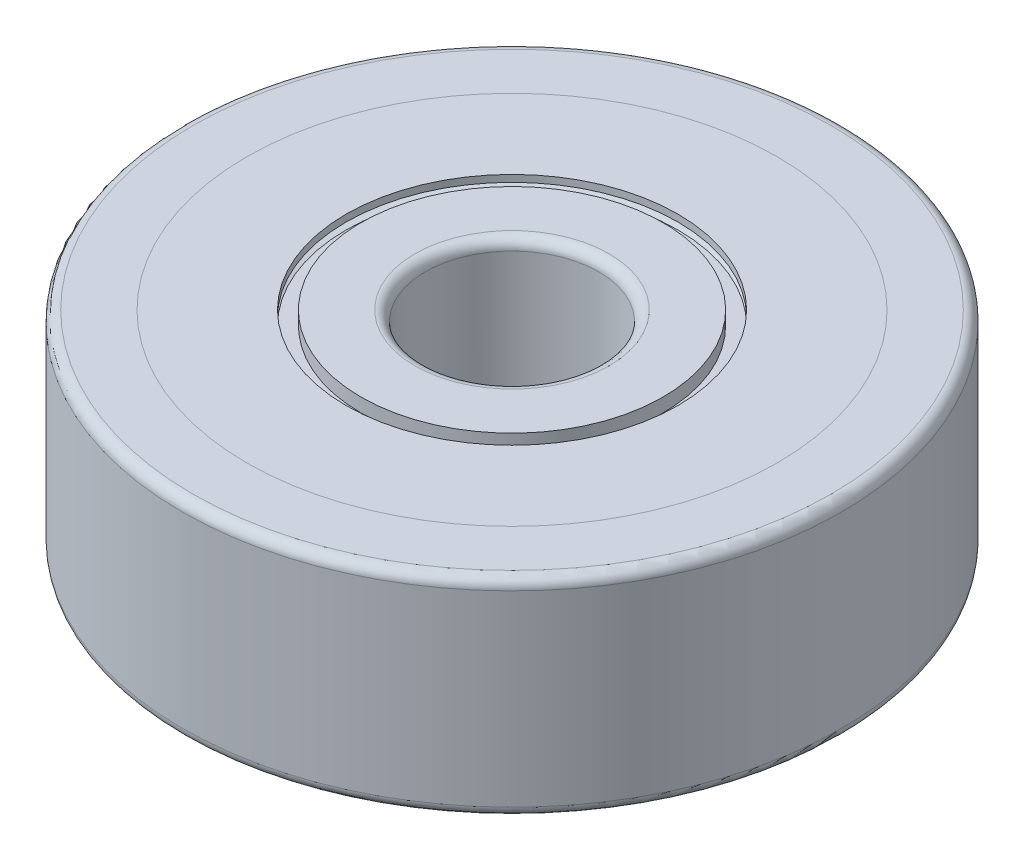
ISO-10303-21;
HEADER;
FILE_DESCRIPTION(('STEP AP214'),'2;1');
FILE_NAME('part.step','',(''),(''),'','','');
FILE_SCHEMA(('AUTOMOTIVE_DESIGN { 1 0 10303 214 1 1 1 1 }'));
ENDSEC;
DATA;
#1=APPLICATION_CONTEXT('core data for automotive mechanical design processes');
#2=APPLICATION_PROTOCOL_DEFINITION('international standard','automotive_design',2000,#1);
#3=PRODUCT_CONTEXT('',#1,'mechanical');
#4=PRODUCT('Part','Part','',(#3));
#5=PRODUCT_RELATED_PRODUCT_CATEGORY('part','',(#4));
#6=PRODUCT_DEFINITION_FORMATION('','',#4);
#7=PRODUCT_DEFINITION_CONTEXT('part definition',#1,'design');
#8=PRODUCT_DEFINITION('design','',#6,#7);
#9=PRODUCT_DEFINITION_SHAPE('','',#8);
#10=(LENGTH_UNIT() NAMED_UNIT(*) SI_UNIT(.MILLI.,.METRE.));
#11=(NAMED_UNIT(*) PLANE_ANGLE_UNIT() SI_UNIT($,.RADIAN.));
#12=(NAMED_UNIT(*) SI_UNIT($,.STERADIAN.) SOLID_ANGLE_UNIT());
#13=UNCERTAINTY_MEASURE_WITH_UNIT(LENGTH_MEASURE(1.E-05),#10,'distance_accuracy_value','');
#14=(GEOMETRIC_REPRESENTATION_CONTEXT(3) GLOBAL_UNCERTAINTY_ASSIGNED_CONTEXT((#13)) GLOBAL_UNIT_ASSIGNED_CONTEXT((#10,
#11,#12)) REPRESENTATION_CONTEXT('',''));
#15=CARTESIAN_POINT('',(0.,0.,0.));
#16=DIRECTION('',(0.,0.,1.));
#17=DIRECTION('',(1.,0.,0.));
#18=AXIS2_PLACEMENT_3D('',#15,#16,#17);
#19=CARTESIAN_POINT('',(0.,6.,0.));
#20=DIRECTION('',(0.,-1.,0.));
#21=DIRECTION('',(0.,0.,-1.));
#22=AXIS2_PLACEMENT_3D('',#19,#20,#21);
#23=CYLINDRICAL_SURFACE('',#22,2.5);
#24=CARTESIAN_POINT('',(0.,5.7,0.));
#25=DIRECTION('',(0.,1.,0.));
#26=DIRECTION('',(0.,0.,-1.));
#27=AXIS2_PLACEMENT_3D('',#24,#25,#26);
#28=CIRCLE('',#27,2.5);
#29=CARTESIAN_POINT('',(0.,5.7,-2.5));
#30=VERTEX_POINT('',#29);
#31=EDGE_CURVE('P0_E81',#30,#30,#28,.F.);
#32=ORIENTED_EDGE('',*,*,#31,.F.);
#33=EDGE_LOOP('',(#32));
#34=FACE_BOUND('',#33,.T.);
#35=CARTESIAN_POINT('',(0.,0.3,0.));
#36=DIRECTION('',(0.,-1.,0.));
#37=DIRECTION('',(0.,0.,1.));
#38=AXIS2_PLACEMENT_3D('',#35,#36,#37);
#39=CIRCLE('',#38,2.5);
#40=CARTESIAN_POINT('',(0.,0.3,2.5));
#41=VERTEX_POINT('',#40);
#42=EDGE_CURVE('P0_E77',#41,#41,#39,.F.);
#43=ORIENTED_EDGE('',*,*,#42,.F.);
#44=EDGE_LOOP('',(#43));
#45=FACE_BOUND('',#44,.T.);
#46=ADVANCED_FACE('P0_F15',(#34,#45),#23,.F.);
#47=CARTESIAN_POINT('',(0.,5.7,0.));
#48=DIRECTION('',(0.,1.,0.));
#49=DIRECTION('',(0.,0.,-1.));
#50=AXIS2_PLACEMENT_3D('',#47,#48,#49);
#51=TOROIDAL_SURFACE('',#50,2.8,0.3);
#52=CARTESIAN_POINT('',(0.,6.,0.));
#53=DIRECTION('',(0.,1.,0.));
#54=DIRECTION('',(0.,0.,1.));
#55=AXIS2_PLACEMENT_3D('',#52,#53,#54);
#56=CIRCLE('',#55,2.8);
#57=CARTESIAN_POINT('',(0.,6.,2.8));
#58=VERTEX_POINT('',#57);
#59=EDGE_CURVE('P0_E80',#58,#58,#56,.F.);
#60=ORIENTED_EDGE('',*,*,#59,.F.);
#61=EDGE_LOOP('',(#60));
#62=FACE_BOUND('',#61,.T.);
#63=ORIENTED_EDGE('',*,*,#31,.T.);
#64=EDGE_LOOP('',(#63));
#65=FACE_BOUND('',#64,.T.);
#66=ADVANCED_FACE('P0_F97',(#62,#65),#51,.T.);
#67=CARTESIAN_POINT('',(0.,0.3,0.));
#68=DIRECTION('',(0.,-1.,0.));
#69=DIRECTION('',(0.,0.,1.));
#70=AXIS2_PLACEMENT_3D('',#67,#68,#69);
#71=TOROIDAL_SURFACE('',#70,2.8,0.3);
#72=ORIENTED_EDGE('',*,*,#42,.T.);
#73=EDGE_LOOP('',(#72));
#74=FACE_BOUND('',#73,.T.);
#75=CARTESIAN_POINT('',(0.,0.,0.));
#76=DIRECTION('',(0.,-1.,0.));
#77=DIRECTION('',(0.,0.,-1.));
#78=AXIS2_PLACEMENT_3D('',#75,#76,#77);
#79=CIRCLE('',#78,2.8);
#80=CARTESIAN_POINT('',(0.,0.,-2.8));
#81=VERTEX_POINT('',#80);
#82=EDGE_CURVE('P0_E40',#81,#81,#79,.F.);
#83=ORIENTED_EDGE('',*,*,#82,.F.);
#84=EDGE_LOOP('',(#83));
#85=FACE_BOUND('',#84,.T.);
#86=ADVANCED_FACE('P0_F64',(#74,#85),#71,.T.);
#87=CARTESIAN_POINT('',(0.,6.,0.));
#88=DIRECTION('',(0.,1.,0.));
#89=DIRECTION('',(0.,0.,1.));
#90=AXIS2_PLACEMENT_3D('',#87,#88,#89);
#91=PLANE('',#90);
#92=CARTESIAN_POINT('',(0.,6.,0.));
#93=DIRECTION('',(0.,1.,0.));
#94=DIRECTION('',(0.,0.,1.));
#95=AXIS2_PLACEMENT_3D('',#92,#93,#94);
#96=CIRCLE('',#95,4.355);
#97=CARTESIAN_POINT('',(0.,6.,4.355));
#98=VERTEX_POINT('',#97);
#99=EDGE_CURVE('P0_E18',#98,#98,#96,.F.);
#100=ORIENTED_EDGE('',*,*,#99,.F.);
#101=EDGE_LOOP('',(#100));
#102=FACE_BOUND('',#101,.T.);
#103=ORIENTED_EDGE('',*,*,#59,.T.);
#104=EDGE_LOOP('',(#103));
#105=FACE_BOUND('',#104,.T.);
#106=ADVANCED_FACE('P0_F58',(#102,#105),#91,.T.);
#107=CARTESIAN_POINT('',(0.,0.,0.));
#108=DIRECTION('',(0.,-1.,0.));
#109=DIRECTION('',(0.,0.,-1.));
#110=AXIS2_PLACEMENT_3D('',#107,#108,#109);
#111=PLANE('',#110);
#112=CARTESIAN_POINT('',(0.,0.,0.));
#113=DIRECTION('',(0.,-1.,0.));
#114=DIRECTION('',(0.,0.,-1.));
#115=AXIS2_PLACEMENT_3D('',#112,#113,#114);
#116=CIRCLE('',#115,4.355);
#117=CARTESIAN_POINT('',(0.,0.,-4.355));
#118=VERTEX_POINT('',#117);
#119=EDGE_CURVE('P0_E122',#118,#118,#116,.F.);
#120=ORIENTED_EDGE('',*,*,#119,.F.);
#121=EDGE_LOOP('',(#120));
#122=FACE_BOUND('',#121,.T.);
#123=ORIENTED_EDGE('',*,*,#82,.T.);
#124=EDGE_LOOP('',(#123));
#125=FACE_BOUND('',#124,.T.);
#126=ADVANCED_FACE('P0_F47',(#122,#125),#111,.T.);
#127=CARTESIAN_POINT('',(0.,5.604,0.));
#128=DIRECTION('',(0.,1.,0.));
#129=DIRECTION('',(0.,0.,1.));
#130=AXIS2_PLACEMENT_3D('',#127,#128,#129);
#131=CYLINDRICAL_SURFACE('',#130,4.355);
#132=CARTESIAN_POINT('',(0.,5.604,0.));
#133=DIRECTION('',(0.,1.,0.));
#134=DIRECTION('',(0.,0.,1.));
#135=AXIS2_PLACEMENT_3D('',#132,#133,#134);
#136=CIRCLE('',#135,4.355);
#137=CARTESIAN_POINT('',(0.,5.604,4.355));
#138=VERTEX_POINT('',#137);
#139=EDGE_CURVE('P0_E120',#138,#138,#136,.T.);
#140=ORIENTED_EDGE('',*,*,#139,.T.);
#141=EDGE_LOOP('',(#140));
#142=FACE_BOUND('',#141,.T.);
#143=ORIENTED_EDGE('',*,*,#99,.T.);
#144=EDGE_LOOP('',(#143));
#145=FACE_BOUND('',#144,.T.);
#146=ADVANCED_FACE('P0_F57',(#142,#145),#131,.T.);
#147=CARTESIAN_POINT('',(0.,0.396,0.));
#148=DIRECTION('',(0.,-1.,0.));
#149=DIRECTION('',(0.,0.,-1.));
#150=AXIS2_PLACEMENT_3D('',#147,#148,#149);
#151=CYLINDRICAL_SURFACE('',#150,4.355);
#152=CARTESIAN_POINT('',(0.,0.396,0.));
#153=DIRECTION('',(0.,-1.,0.));
#154=DIRECTION('',(0.,0.,-1.));
#155=AXIS2_PLACEMENT_3D('',#152,#153,#154);
#156=CIRCLE('',#155,4.355);
#157=CARTESIAN_POINT('',(0.,0.396,-4.355));
#158=VERTEX_POINT('',#157);
#159=EDGE_CURVE('P0_E117',#158,#158,#156,.T.);
#160=ORIENTED_EDGE('',*,*,#159,.T.);
#161=EDGE_LOOP('',(#160));
#162=FACE_BOUND('',#161,.T.);
#163=ORIENTED_EDGE('',*,*,#119,.T.);
#164=EDGE_LOOP('',(#163));
#165=FACE_BOUND('',#164,.T.);
#166=ADVANCED_FACE('P0_F163',(#162,#165),#151,.T.);
#167=CARTESIAN_POINT('',(0.,5.604,0.));
#168=DIRECTION('',(0.,-1.,0.));
#169=DIRECTION('',(0.,0.,-1.));
#170=AXIS2_PLACEMENT_3D('',#167,#168,#169);
#171=PLANE('',#170);
#172=ORIENTED_EDGE('',*,*,#139,.F.);
#173=EDGE_LOOP('',(#172));
#174=FACE_BOUND('',#173,.T.);
#175=CARTESIAN_POINT('',(0.,5.604,0.));
#176=DIRECTION('',(0.,1.,0.));
#177=DIRECTION('',(0.,0.,1.));
#178=AXIS2_PLACEMENT_3D('',#175,#176,#177);
#179=CIRCLE('',#178,4.782);
#180=CARTESIAN_POINT('',(0.,5.604,4.782));
#181=VERTEX_POINT('',#180);
#182=EDGE_CURVE('P0_E114',#181,#181,#179,.F.);
#183=ORIENTED_EDGE('',*,*,#182,.F.);
#184=EDGE_LOOP('',(#183));
#185=FACE_BOUND('',#184,.T.);
#186=ADVANCED_FACE('P0_F160',(#174,#185),#171,.F.);
#187=CARTESIAN_POINT('',(0.,0.396,0.));
#188=DIRECTION('',(0.,1.,0.));
#189=DIRECTION('',(0.,0.,1.));
#190=AXIS2_PLACEMENT_3D('',#187,#188,#189);
#191=PLANE('',#190);
#192=ORIENTED_EDGE('',*,*,#159,.F.);
#193=EDGE_LOOP('',(#192));
#194=FACE_BOUND('',#193,.T.);
#195=CARTESIAN_POINT('',(0.,0.396,0.));
#196=DIRECTION('',(0.,1.,0.));
#197=DIRECTION('',(0.,0.,1.));
#198=AXIS2_PLACEMENT_3D('',#195,#196,#197);
#199=CIRCLE('',#198,4.782);
#200=CARTESIAN_POINT('',(0.,0.396,4.782));
#201=VERTEX_POINT('',#200);
#202=EDGE_CURVE('P0_E27',#201,#201,#199,.T.);
#203=ORIENTED_EDGE('',*,*,#202,.F.);
#204=EDGE_LOOP('',(#203));
#205=FACE_BOUND('',#204,.T.);
#206=ADVANCED_FACE('P0_F156',(#194,#205),#191,.F.);
#207=CARTESIAN_POINT('',(0.,0.,0.));
#208=DIRECTION('',(0.,1.,0.));
#209=DIRECTION('',(0.,0.,1.));
#210=AXIS2_PLACEMENT_3D('',#207,#208,#209);
#211=CYLINDRICAL_SURFACE('',#210,4.782);
#212=CARTESIAN_POINT('',(0.,4.71069459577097,0.));
#213=DIRECTION('',(0.,1.,0.));
#214=DIRECTION('',(0.,0.,-1.));
#215=AXIS2_PLACEMENT_3D('',#212,#213,#214);
#216=CIRCLE('',#215,4.782);
#217=CARTESIAN_POINT('',(0.,4.71069459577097,-4.782));
#218=VERTEX_POINT('',#217);
#219=EDGE_CURVE('P0_E22',#218,#218,#216,.T.);
#220=ORIENTED_EDGE('',*,*,#219,.T.);
#221=EDGE_LOOP('',(#220));
#222=FACE_BOUND('',#221,.T.);
#223=ORIENTED_EDGE('',*,*,#182,.T.);
#224=EDGE_LOOP('',(#223));
#225=FACE_BOUND('',#224,.T.);
#226=ADVANCED_FACE('P0_F150',(#222,#225),#211,.T.);
#227=CARTESIAN_POINT('',(0.,0.,0.));
#228=DIRECTION('',(0.,1.,0.));
#229=DIRECTION('',(0.,0.,1.));
#230=AXIS2_PLACEMENT_3D('',#227,#228,#229);
#231=CYLINDRICAL_SURFACE('',#230,4.782);
#232=CARTESIAN_POINT('',(0.,1.28930540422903,0.));
#233=DIRECTION('',(0.,1.,0.));
#234=DIRECTION('',(0.,0.,-1.));
#235=AXIS2_PLACEMENT_3D('',#232,#233,#234);
#236=CIRCLE('',#235,4.782);
#237=CARTESIAN_POINT('',(0.,1.28930540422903,-4.782));
#238=VERTEX_POINT('',#237);
#239=EDGE_CURVE('P0_E10',#238,#238,#236,.F.);
#240=ORIENTED_EDGE('',*,*,#239,.T.);
#241=EDGE_LOOP('',(#240));
#242=FACE_BOUND('',#241,.T.);
#243=ORIENTED_EDGE('',*,*,#202,.T.);
#244=EDGE_LOOP('',(#243));
#245=FACE_BOUND('',#244,.T.);
#246=ADVANCED_FACE('P0_F144',(#242,#245),#231,.T.);
#247=CARTESIAN_POINT('',(0.,3.,0.));
#248=DIRECTION('',(0.,1.,0.));
#249=DIRECTION('',(0.,0.,-1.));
#250=AXIS2_PLACEMENT_3D('',#247,#248,#249);
#251=TOROIDAL_SURFACE('',#250,6.,2.1);
#252=ORIENTED_EDGE('',*,*,#239,.F.);
#253=EDGE_LOOP('',(#252));
#254=FACE_BOUND('',#253,.T.);
#255=ORIENTED_EDGE('',*,*,#219,.F.);
#256=EDGE_LOOP('',(#255));
#257=FACE_BOUND('',#256,.T.);
#258=ADVANCED_FACE('P0_F142',(#254,#257),#251,.F.);
#259=CLOSED_SHELL('',(#46,#66,#86,#106,#126,#146,#166,#186,#206,#226,#246,#258));
#260=MANIFOLD_SOLID_BREP('P0_B1',#259);
#261=CARTESIAN_POINT('',(0.,3.,0.));
#262=DIRECTION('',(0.,1.,0.));
#263=DIRECTION('',(0.,0.,-1.));
#264=AXIS2_PLACEMENT_3D('',#261,#262,#263);
#265=TOROIDAL_SURFACE('',#264,6.,2.1);
#266=CARTESIAN_POINT('',(0.,4.71069459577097,0.));
#267=DIRECTION('',(0.,-1.,0.));
#268=DIRECTION('',(0.,0.,-1.));
#269=AXIS2_PLACEMENT_3D('',#266,#267,#268);
#270=CIRCLE('',#269,7.218);
#271=CARTESIAN_POINT('',(0.,4.71069459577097,-7.218));
#272=VERTEX_POINT('',#271);
#273=EDGE_CURVE('P1_E141',#272,#272,#270,.F.);
#274=ORIENTED_EDGE('',*,*,#273,.T.);
#275=EDGE_LOOP('',(#274));
#276=FACE_BOUND('',#275,.T.);
#277=CARTESIAN_POINT('',(0.,1.28930540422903,0.));
#278=DIRECTION('',(0.,-1.,0.));
#279=DIRECTION('',(0.,0.,-1.));
#280=AXIS2_PLACEMENT_3D('',#277,#278,#279);
#281=CIRCLE('',#280,7.218);
#282=CARTESIAN_POINT('',(0.,1.28930540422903,-7.218));
#283=VERTEX_POINT('',#282);
#284=EDGE_CURVE('P1_E144',#283,#283,#281,.T.);
#285=ORIENTED_EDGE('',*,*,#284,.T.);
#286=EDGE_LOOP('',(#285));
#287=FACE_BOUND('',#286,.T.);
#288=ADVANCED_FACE('P1_F15',(#276,#287),#265,.F.);
#289=CARTESIAN_POINT('',(0.,6.,0.));
#290=DIRECTION('',(0.,-1.,0.));
#291=DIRECTION('',(0.,0.,-1.));
#292=AXIS2_PLACEMENT_3D('',#289,#290,#291);
#293=CYLINDRICAL_SURFACE('',#292,7.218);
#294=ORIENTED_EDGE('',*,*,#284,.F.);
#295=EDGE_LOOP('',(#294));
#296=FACE_BOUND('',#295,.T.);
#297=CARTESIAN_POINT('',(0.,0.396,0.));
#298=DIRECTION('',(0.,-1.,0.));
#299=DIRECTION('',(0.,0.,-1.));
#300=AXIS2_PLACEMENT_3D('',#297,#298,#299);
#301=CIRCLE('',#300,7.218);
#302=CARTESIAN_POINT('',(0.,0.396,-7.218));
#303=VERTEX_POINT('',#302);
#304=EDGE_CURVE('P1_E19',#303,#303,#301,.T.);
#305=ORIENTED_EDGE('',*,*,#304,.T.);
#306=EDGE_LOOP('',(#305));
#307=FACE_BOUND('',#306,.T.);
#308=ADVANCED_FACE('P1_F101',(#296,#307),#293,.F.);
#309=CARTESIAN_POINT('',(0.,6.,0.));
#310=DIRECTION('',(0.,-1.,0.));
#311=DIRECTION('',(0.,0.,-1.));
#312=AXIS2_PLACEMENT_3D('',#309,#310,#311);
#313=CYLINDRICAL_SURFACE('',#312,7.218);
#314=ORIENTED_EDGE('',*,*,#273,.F.);
#315=EDGE_LOOP('',(#314));
#316=FACE_BOUND('',#315,.T.);
#317=CARTESIAN_POINT('',(0.,5.604,0.));
#318=DIRECTION('',(0.,-1.,0.));
#319=DIRECTION('',(0.,0.,-1.));
#320=AXIS2_PLACEMENT_3D('',#317,#318,#319);
#321=CIRCLE('',#320,7.218);
#322=CARTESIAN_POINT('',(0.,5.604,-7.218));
#323=VERTEX_POINT('',#322);
#324=EDGE_CURVE('P1_E136',#323,#323,#321,.F.);
#325=ORIENTED_EDGE('',*,*,#324,.T.);
#326=EDGE_LOOP('',(#325));
#327=FACE_BOUND('',#326,.T.);
#328=ADVANCED_FACE('P1_F98',(#316,#327),#313,.F.);
#329=CARTESIAN_POINT('',(0.,0.396,0.));
#330=DIRECTION('',(0.,1.,0.));
#331=DIRECTION('',(0.,0.,1.));
#332=AXIS2_PLACEMENT_3D('',#329,#330,#331);
#333=PLANE('',#332);
#334=ORIENTED_EDGE('',*,*,#304,.F.);
#335=EDGE_LOOP('',(#334));
#336=FACE_BOUND('',#335,.T.);
#337=CARTESIAN_POINT('',(0.,0.396,0.));
#338=DIRECTION('',(0.,1.,0.));
#339=DIRECTION('',(0.,0.,1.));
#340=AXIS2_PLACEMENT_3D('',#337,#338,#339);
#341=CIRCLE('',#340,7.645);
#342=CARTESIAN_POINT('',(0.,0.396,7.645));
#343=VERTEX_POINT('',#342);
#344=EDGE_CURVE('P1_E134',#343,#343,#341,.F.);
#345=ORIENTED_EDGE('',*,*,#344,.T.);
#346=EDGE_LOOP('',(#345));
#347=FACE_BOUND('',#346,.T.);
#348=ADVANCED_FACE('P1_F94',(#336,#347),#333,.F.);
#349=CARTESIAN_POINT('',(0.,5.604,0.));
#350=DIRECTION('',(0.,-1.,0.));
#351=DIRECTION('',(0.,0.,-1.));
#352=AXIS2_PLACEMENT_3D('',#349,#350,#351);
#353=PLANE('',#352);
#354=ORIENTED_EDGE('',*,*,#324,.F.);
#355=EDGE_LOOP('',(#354));
#356=FACE_BOUND('',#355,.T.);
#357=CARTESIAN_POINT('',(0.,5.604,0.));
#358=DIRECTION('',(0.,-1.,0.));
#359=DIRECTION('',(0.,0.,-1.));
#360=AXIS2_PLACEMENT_3D('',#357,#358,#359);
#361=CIRCLE('',#360,7.645);
#362=CARTESIAN_POINT('',(0.,5.604,-7.645));
#363=VERTEX_POINT('',#362);
#364=EDGE_CURVE('P1_E127',#363,#363,#361,.F.);
#365=ORIENTED_EDGE('',*,*,#364,.T.);
#366=EDGE_LOOP('',(#365));
#367=FACE_BOUND('',#366,.T.);
#368=ADVANCED_FACE('P1_F90',(#356,#367),#353,.F.);
#369=CARTESIAN_POINT('',(0.,0.,0.));
#370=DIRECTION('',(0.,1.,0.));
#371=DIRECTION('',(0.,0.,1.));
#372=AXIS2_PLACEMENT_3D('',#369,#370,#371);
#373=CYLINDRICAL_SURFACE('',#372,7.645);
#374=CARTESIAN_POINT('',(0.,0.,0.));
#375=DIRECTION('',(0.,1.,0.));
#376=DIRECTION('',(0.,0.,1.));
#377=AXIS2_PLACEMENT_3D('',#374,#375,#376);
#378=CIRCLE('',#377,7.645);
#379=CARTESIAN_POINT('',(0.,0.,7.645));
#380=VERTEX_POINT('',#379);
#381=EDGE_CURVE('P1_E122',#380,#380,#378,.T.);
#382=ORIENTED_EDGE('',*,*,#381,.F.);
#383=EDGE_LOOP('',(#382));
#384=FACE_BOUND('',#383,.T.);
#385=ORIENTED_EDGE('',*,*,#344,.F.);
#386=EDGE_LOOP('',(#385));
#387=FACE_BOUND('',#386,.T.);
#388=ADVANCED_FACE('P1_F86',(#384,#387),#373,.F.);
#389=CARTESIAN_POINT('',(0.,6.,0.));
#390=DIRECTION('',(0.,-1.,0.));
#391=DIRECTION('',(0.,0.,-1.));
#392=AXIS2_PLACEMENT_3D('',#389,#390,#391);
#393=CYLINDRICAL_SURFACE('',#392,7.645);
#394=CARTESIAN_POINT('',(0.,6.,0.));
#395=DIRECTION('',(0.,-1.,0.));
#396=DIRECTION('',(0.,0.,-1.));
#397=AXIS2_PLACEMENT_3D('',#394,#395,#396);
#398=CIRCLE('',#397,7.645);
#399=CARTESIAN_POINT('',(0.,6.,-7.645));
#400=VERTEX_POINT('',#399);
#401=EDGE_CURVE('P1_E120',#400,#400,#398,.T.);
#402=ORIENTED_EDGE('',*,*,#401,.F.);
#403=EDGE_LOOP('',(#402));
#404=FACE_BOUND('',#403,.T.);
#405=ORIENTED_EDGE('',*,*,#364,.F.);
#406=EDGE_LOOP('',(#405));
#407=FACE_BOUND('',#406,.T.);
#408=ADVANCED_FACE('P1_F82',(#404,#407),#393,.F.);
#409=CARTESIAN_POINT('',(0.,0.,0.));
#410=DIRECTION('',(0.,-1.,0.));
#411=DIRECTION('',(0.,0.,-1.));
#412=AXIS2_PLACEMENT_3D('',#409,#410,#411);
#413=PLANE('',#412);
#414=CARTESIAN_POINT('',(0.,0.,0.));
#415=DIRECTION('',(0.,1.,0.));
#416=DIRECTION('',(0.,0.,-1.));
#417=AXIS2_PLACEMENT_3D('',#414,#415,#416);
#418=CIRCLE('',#417,9.2);
#419=CARTESIAN_POINT('',(0.,0.,-9.2));
#420=VERTEX_POINT('',#419);
#421=EDGE_CURVE('P1_E66',#420,#420,#418,.T.);
#422=ORIENTED_EDGE('',*,*,#421,.F.);
#423=EDGE_LOOP('',(#422));
#424=FACE_BOUND('',#423,.T.);
#425=ORIENTED_EDGE('',*,*,#381,.T.);
#426=EDGE_LOOP('',(#425));
#427=FACE_BOUND('',#426,.T.);
#428=ADVANCED_FACE('P1_F72',(#424,#427),#413,.T.);
#429=CARTESIAN_POINT('',(0.,6.,0.));
#430=DIRECTION('',(0.,1.,0.));
#431=DIRECTION('',(0.,0.,1.));
#432=AXIS2_PLACEMENT_3D('',#429,#430,#431);
#433=PLANE('',#432);
#434=CARTESIAN_POINT('',(0.,6.,0.));
#435=DIRECTION('',(0.,-1.,0.));
#436=DIRECTION('',(0.,0.,1.));
#437=AXIS2_PLACEMENT_3D('',#434,#435,#436);
#438=CIRCLE('',#437,9.2);
#439=CARTESIAN_POINT('',(0.,6.,9.2));
#440=VERTEX_POINT('',#439);
#441=EDGE_CURVE('P1_E28',#440,#440,#438,.T.);
#442=ORIENTED_EDGE('',*,*,#441,.F.);
#443=EDGE_LOOP('',(#442));
#444=FACE_BOUND('',#443,.T.);
#445=ORIENTED_EDGE('',*,*,#401,.T.);
#446=EDGE_LOOP('',(#445));
#447=FACE_BOUND('',#446,.T.);
#448=ADVANCED_FACE('P1_F81',(#444,#447),#433,.T.);
#449=CARTESIAN_POINT('',(0.,0.3,0.));
#450=DIRECTION('',(0.,-1.,0.));
#451=DIRECTION('',(0.,0.,1.));
#452=AXIS2_PLACEMENT_3D('',#449,#450,#451);
#453=TOROIDAL_SURFACE('',#452,9.2,0.3);
#454=CARTESIAN_POINT('',(0.,0.3,0.));
#455=DIRECTION('',(0.,1.,0.));
#456=DIRECTION('',(0.,0.,1.));
#457=AXIS2_PLACEMENT_3D('',#454,#455,#456);
#458=CIRCLE('',#457,9.5);
#459=CARTESIAN_POINT('',(0.,0.3,9.5));
#460=VERTEX_POINT('',#459);
#461=EDGE_CURVE('P1_E23',#460,#460,#458,.T.);
#462=ORIENTED_EDGE('',*,*,#461,.F.);
#463=EDGE_LOOP('',(#462));
#464=FACE_BOUND('',#463,.T.);
#465=ORIENTED_EDGE('',*,*,#421,.T.);
#466=EDGE_LOOP('',(#465));
#467=FACE_BOUND('',#466,.T.);
#468=ADVANCED_FACE('P1_F46',(#464,#467),#453,.T.);
#469=CARTESIAN_POINT('',(0.,5.7,0.));
#470=DIRECTION('',(0.,1.,0.));
#471=DIRECTION('',(0.,0.,-1.));
#472=AXIS2_PLACEMENT_3D('',#469,#470,#471);
#473=TOROIDAL_SURFACE('',#472,9.2,0.3);
#474=CARTESIAN_POINT('',(0.,5.7,0.));
#475=DIRECTION('',(0.,1.,0.));
#476=DIRECTION('',(0.,0.,1.));
#477=AXIS2_PLACEMENT_3D('',#474,#475,#476);
#478=CIRCLE('',#477,9.5);
#479=CARTESIAN_POINT('',(0.,5.7,9.5));
#480=VERTEX_POINT('',#479);
#481=EDGE_CURVE('P1_E10',#480,#480,#478,.F.);
#482=ORIENTED_EDGE('',*,*,#481,.F.);
#483=EDGE_LOOP('',(#482));
#484=FACE_BOUND('',#483,.T.);
#485=ORIENTED_EDGE('',*,*,#441,.T.);
#486=EDGE_LOOP('',(#485));
#487=FACE_BOUND('',#486,.T.);
#488=ADVANCED_FACE('P1_F40',(#484,#487),#473,.T.);
#489=CARTESIAN_POINT('',(0.,0.,0.));
#490=DIRECTION('',(0.,1.,0.));
#491=DIRECTION('',(0.,0.,1.));
#492=AXIS2_PLACEMENT_3D('',#489,#490,#491);
#493=CYLINDRICAL_SURFACE('',#492,9.5);
#494=ORIENTED_EDGE('',*,*,#481,.T.);
#495=EDGE_LOOP('',(#494));
#496=FACE_BOUND('',#495,.T.);
#497=ORIENTED_EDGE('',*,*,#461,.T.);
#498=EDGE_LOOP('',(#497));
#499=FACE_BOUND('',#498,.T.);
#500=ADVANCED_FACE('P1_F45',(#496,#499),#493,.T.);
#501=CLOSED_SHELL('',(#288,#308,#328,#348,#368,#388,#408,#428,#448,#468,#488,#500));
#502=MANIFOLD_SOLID_BREP('P1_B1',#501);
#503=CARTESIAN_POINT('',(0.,3.,0.));
#504=DIRECTION('',(0.,1.,0.));
#505=DIRECTION('',(0.,0.,-1.));
#506=AXIS2_PLACEMENT_3D('',#503,#504,#505);
#507=TOROIDAL_SURFACE('',#506,6.,2.1);
#508=ADVANCED_FACE('P2_F14',(),#507,.T.);
#509=CLOSED_SHELL('',(#508));
#510=MANIFOLD_SOLID_BREP('P2_B1',#509);
#511=CARTESIAN_POINT('',(0.,5.802,0.));
#512=DIRECTION('',(0.,1.,0.));
#513=DIRECTION('',(0.,0.,1.));
#514=AXIS2_PLACEMENT_3D('',#511,#512,#513);
#515=PLANE('',#514);
#516=CARTESIAN_POINT('',(0.,5.802,0.));
#517=DIRECTION('',(0.,1.,0.));
#518=DIRECTION('',(0.,0.,1.));
#519=AXIS2_PLACEMENT_3D('',#516,#517,#518);
#520=CIRCLE('',#519,7.645);
#521=CARTESIAN_POINT('',(0.,5.802,7.645));
#522=VERTEX_POINT('',#521);
#523=EDGE_CURVE('P3_E27',#522,#522,#520,.T.);
#524=ORIENTED_EDGE('',*,*,#523,.F.);
#525=EDGE_LOOP('',(#524));
#526=FACE_BOUND('',#525,.T.);
#527=CARTESIAN_POINT('',(0.,5.802,0.));
#528=DIRECTION('',(0.,-1.,0.));
#529=DIRECTION('',(0.,0.,-1.));
#530=AXIS2_PLACEMENT_3D('',#527,#528,#529);
#531=CIRCLE('',#530,4.782);
#532=CARTESIAN_POINT('',(0.,5.802,-4.782));
#533=VERTEX_POINT('',#532);
#534=EDGE_CURVE('P3_E18',#533,#533,#531,.F.);
#535=ORIENTED_EDGE('',*,*,#534,.T.);
#536=EDGE_LOOP('',(#535));
#537=FACE_BOUND('',#536,.T.);
#538=ADVANCED_FACE('P3_F15',(#526,#537),#515,.F.);
#539=CARTESIAN_POINT('',(0.,6.,0.));
#540=DIRECTION('',(0.,-1.,0.));
#541=DIRECTION('',(0.,0.,-1.));
#542=AXIS2_PLACEMENT_3D('',#539,#540,#541);
#543=CYLINDRICAL_SURFACE('',#542,4.782);
#544=ORIENTED_EDGE('',*,*,#534,.F.);
#545=EDGE_LOOP('',(#544));
#546=FACE_BOUND('',#545,.T.);
#547=CARTESIAN_POINT('',(0.,6.,0.));
#548=DIRECTION('',(0.,-1.,0.));
#549=DIRECTION('',(0.,0.,-1.));
#550=AXIS2_PLACEMENT_3D('',#547,#548,#549);
#551=CIRCLE('',#550,4.782);
#552=CARTESIAN_POINT('',(0.,6.,-4.782));
#553=VERTEX_POINT('',#552);
#554=EDGE_CURVE('P3_E22',#553,#553,#551,.T.);
#555=ORIENTED_EDGE('',*,*,#554,.F.);
#556=EDGE_LOOP('',(#555));
#557=FACE_BOUND('',#556,.T.);
#558=ADVANCED_FACE('P3_F36',(#546,#557),#543,.F.);
#559=CARTESIAN_POINT('',(0.,0.,0.));
#560=DIRECTION('',(0.,1.,0.));
#561=DIRECTION('',(0.,0.,1.));
#562=AXIS2_PLACEMENT_3D('',#559,#560,#561);
#563=CYLINDRICAL_SURFACE('',#562,7.645);
#564=CARTESIAN_POINT('',(0.,6.,0.));
#565=DIRECTION('',(0.,1.,0.));
#566=DIRECTION('',(0.,0.,1.));
#567=AXIS2_PLACEMENT_3D('',#564,#565,#566);
#568=CIRCLE('',#567,7.645);
#569=CARTESIAN_POINT('',(0.,6.,7.645));
#570=VERTEX_POINT('',#569);
#571=EDGE_CURVE('P3_E10',#570,#570,#568,.T.);
#572=ORIENTED_EDGE('',*,*,#571,.F.);
#573=EDGE_LOOP('',(#572));
#574=FACE_BOUND('',#573,.T.);
#575=ORIENTED_EDGE('',*,*,#523,.T.);
#576=EDGE_LOOP('',(#575));
#577=FACE_BOUND('',#576,.T.);
#578=ADVANCED_FACE('P3_F39',(#574,#577),#563,.T.);
#579=CARTESIAN_POINT('',(0.,6.,0.));
#580=DIRECTION('',(0.,1.,0.));
#581=DIRECTION('',(0.,0.,1.));
#582=AXIS2_PLACEMENT_3D('',#579,#580,#581);
#583=PLANE('',#582);
#584=ORIENTED_EDGE('',*,*,#571,.T.);
#585=EDGE_LOOP('',(#584));
#586=FACE_BOUND('',#585,.T.);
#587=ORIENTED_EDGE('',*,*,#554,.T.);
#588=EDGE_LOOP('',(#587));
#589=FACE_BOUND('',#588,.T.);
#590=ADVANCED_FACE('P3_F42',(#586,#589),#583,.T.);
#591=CLOSED_SHELL('',(#538,#558,#578,#590));
#592=MANIFOLD_SOLID_BREP('P3_B1',#591);
#593=CARTESIAN_POINT('',(0.,0.198,0.));
#594=DIRECTION('',(0.,1.,0.));
#595=DIRECTION('',(0.,0.,1.));
#596=AXIS2_PLACEMENT_3D('',#593,#594,#595);
#597=PLANE('',#596);
#598=CARTESIAN_POINT('',(0.,0.198,0.));
#599=DIRECTION('',(0.,1.,0.));
#600=DIRECTION('',(0.,0.,1.));
#601=AXIS2_PLACEMENT_3D('',#598,#599,#600);
#602=CIRCLE('',#601,7.645);
#603=CARTESIAN_POINT('',(0.,0.198,7.645));
#604=VERTEX_POINT('',#603);
#605=EDGE_CURVE('P4_E27',#604,#604,#602,.F.);
#606=ORIENTED_EDGE('',*,*,#605,.F.);
#607=EDGE_LOOP('',(#606));
#608=FACE_BOUND('',#607,.T.);
#609=CARTESIAN_POINT('',(0.,0.198,0.));
#610=DIRECTION('',(0.,-1.,0.));
#611=DIRECTION('',(0.,0.,-1.));
#612=AXIS2_PLACEMENT_3D('',#609,#610,#611);
#613=CIRCLE('',#612,4.782);
#614=CARTESIAN_POINT('',(0.,0.198,-4.782));
#615=VERTEX_POINT('',#614);
#616=EDGE_CURVE('P4_E18',#615,#615,#613,.T.);
#617=ORIENTED_EDGE('',*,*,#616,.T.);
#618=EDGE_LOOP('',(#617));
#619=FACE_BOUND('',#618,.T.);
#620=ADVANCED_FACE('P4_F15',(#608,#619),#597,.T.);
#621=CARTESIAN_POINT('',(0.,0.198,0.));
#622=DIRECTION('',(0.,-1.,0.));
#623=DIRECTION('',(0.,0.,-1.));
#624=AXIS2_PLACEMENT_3D('',#621,#622,#623);
#625=CYLINDRICAL_SURFACE('',#624,4.782);
#626=ORIENTED_EDGE('',*,*,#616,.F.);
#627=EDGE_LOOP('',(#626));
#628=FACE_BOUND('',#627,.T.);
#629=CARTESIAN_POINT('',(0.,0.,0.));
#630=DIRECTION('',(0.,-1.,0.));
#631=DIRECTION('',(0.,0.,-1.));
#632=AXIS2_PLACEMENT_3D('',#629,#630,#631);
#633=CIRCLE('',#632,4.782);
#634=CARTESIAN_POINT('',(0.,0.,-4.782));
#635=VERTEX_POINT('',#634);
#636=EDGE_CURVE('P4_E22',#635,#635,#633,.F.);
#637=ORIENTED_EDGE('',*,*,#636,.F.);
#638=EDGE_LOOP('',(#637));
#639=FACE_BOUND('',#638,.T.);
#640=ADVANCED_FACE('P4_F36',(#628,#639),#625,.F.);
#641=CARTESIAN_POINT('',(0.,0.,0.));
#642=DIRECTION('',(0.,1.,0.));
#643=DIRECTION('',(0.,0.,1.));
#644=AXIS2_PLACEMENT_3D('',#641,#642,#643);
#645=CYLINDRICAL_SURFACE('',#644,7.645);
#646=CARTESIAN_POINT('',(0.,0.,0.));
#647=DIRECTION('',(0.,1.,0.));
#648=DIRECTION('',(0.,0.,1.));
#649=AXIS2_PLACEMENT_3D('',#646,#647,#648);
#650=CIRCLE('',#649,7.645);
#651=CARTESIAN_POINT('',(0.,0.,7.645));
#652=VERTEX_POINT('',#651);
#653=EDGE_CURVE('P4_E10',#652,#652,#650,.F.);
#654=ORIENTED_EDGE('',*,*,#653,.F.);
#655=EDGE_LOOP('',(#654));
#656=FACE_BOUND('',#655,.T.);
#657=ORIENTED_EDGE('',*,*,#605,.T.);
#658=EDGE_LOOP('',(#657));
#659=FACE_BOUND('',#658,.T.);
#660=ADVANCED_FACE('P4_F39',(#656,#659),#645,.T.);
#661=CARTESIAN_POINT('',(0.,0.,0.));
#662=DIRECTION('',(0.,-1.,0.));
#663=DIRECTION('',(0.,0.,-1.));
#664=AXIS2_PLACEMENT_3D('',#661,#662,#663);
#665=PLANE('',#664);
#666=ORIENTED_EDGE('',*,*,#653,.T.);
#667=EDGE_LOOP('',(#666));
#668=FACE_BOUND('',#667,.T.);
#669=ORIENTED_EDGE('',*,*,#636,.T.);
#670=EDGE_LOOP('',(#669));
#671=FACE_BOUND('',#670,.T.);
#672=ADVANCED_FACE('P4_F42',(#668,#671),#665,.T.);
#673=CLOSED_SHELL('',(#620,#640,#660,#672));
#674=MANIFOLD_SOLID_BREP('P4_B1',#673);
#675=ADVANCED_BREP_SHAPE_REPRESENTATION('',(#18,#260,#502,#510,#592,#674),#14);
#676=SHAPE_DEFINITION_REPRESENTATION(#9,#675);
ENDSEC;
END-ISO-10303-21;
